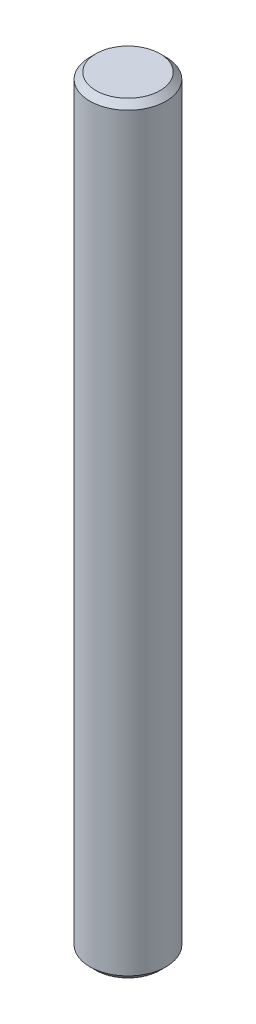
from build123d import *

# Parameters (mm, degrees)
SKETCH2_R           = 12.5
BOSS_EXTRUDE1_DEPTH = 125
CHAMFER1_SIZE       = 2


with BuildPart() as part:
    # Sketch2 → Boss-Extrude1 (new, symmetric)
    with BuildSketch(Plane(origin=(0, 0, 0), x_dir=(0, 0, -1), z_dir=(0, 1, 0))):
        with Locations(Location((0, 0, 0), (0, 0, 180))):
            Circle(SKETCH2_R)
    extrude(amount=BOSS_EXTRUDE1_DEPTH, both=True)

    # Chamfer1
    chamfer1_edges = [part.edges().sort_by_distance(p)[0] for p in [
        (0, -125, -12.5),
        (0, 125, -12.5),
    ]]
    chamfer(chamfer1_edges, length=CHAMFER1_SIZE)


solid = part.part
